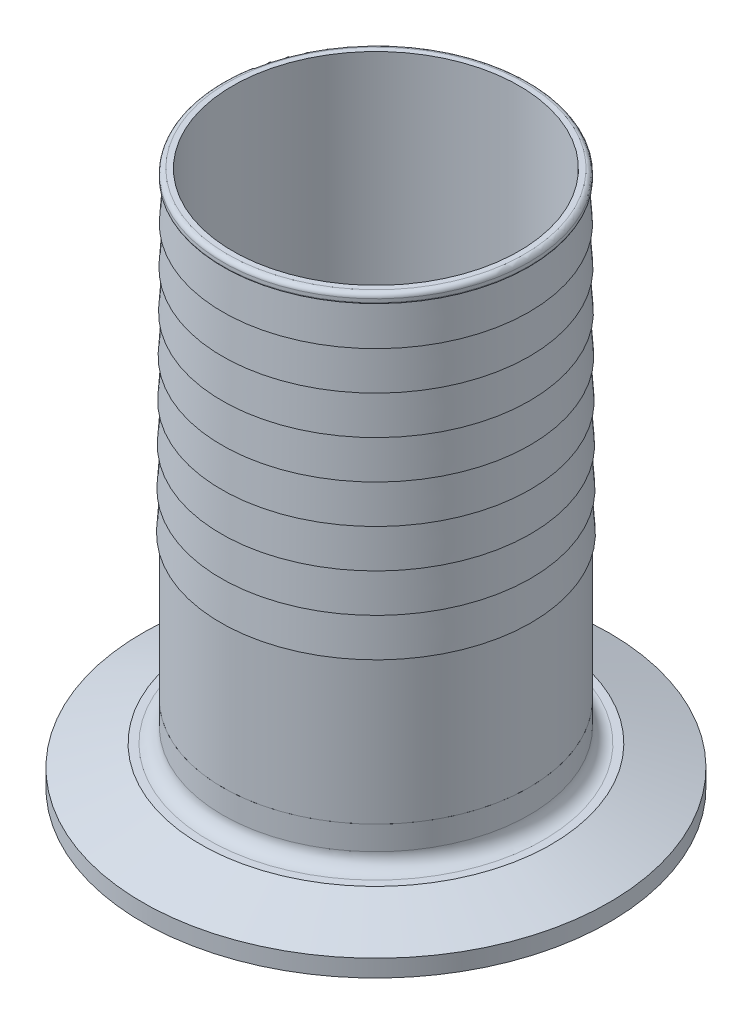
ISO-10303-21;
HEADER;
FILE_DESCRIPTION(('STEP AP214'),'2;1');
FILE_NAME('part.step','',(''),(''),'','','');
FILE_SCHEMA(('AUTOMOTIVE_DESIGN { 1 0 10303 214 1 1 1 1 }'));
ENDSEC;
DATA;
#1=APPLICATION_CONTEXT('core data for automotive mechanical design processes');
#2=APPLICATION_PROTOCOL_DEFINITION('international standard','automotive_design',2000,#1);
#3=PRODUCT_CONTEXT('',#1,'mechanical');
#4=PRODUCT('Part','Part','',(#3));
#5=PRODUCT_RELATED_PRODUCT_CATEGORY('part','',(#4));
#6=PRODUCT_DEFINITION_FORMATION('','',#4);
#7=PRODUCT_DEFINITION_CONTEXT('part definition',#1,'design');
#8=PRODUCT_DEFINITION('design','',#6,#7);
#9=PRODUCT_DEFINITION_SHAPE('','',#8);
#10=(LENGTH_UNIT() NAMED_UNIT(*) SI_UNIT(.MILLI.,.METRE.));
#11=(NAMED_UNIT(*) PLANE_ANGLE_UNIT() SI_UNIT($,.RADIAN.));
#12=(NAMED_UNIT(*) SI_UNIT($,.STERADIAN.) SOLID_ANGLE_UNIT());
#13=UNCERTAINTY_MEASURE_WITH_UNIT(LENGTH_MEASURE(1.E-05),#10,'distance_accuracy_value','');
#14=(GEOMETRIC_REPRESENTATION_CONTEXT(3) GLOBAL_UNCERTAINTY_ASSIGNED_CONTEXT((#13)) GLOBAL_UNIT_ASSIGNED_CONTEXT((#10,
#11,#12)) REPRESENTATION_CONTEXT('',''));
#15=CARTESIAN_POINT('',(0.,0.,0.));
#16=DIRECTION('',(0.,0.,1.));
#17=DIRECTION('',(1.,0.,0.));
#18=AXIS2_PLACEMENT_3D('',#15,#16,#17);
#19=CARTESIAN_POINT('',(57.9341349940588,46.6260461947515,65.4384429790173));
#20=DIRECTION('',(0.,-1.,0.));
#21=DIRECTION('',(0.146017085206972,0.,-0.989282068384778));
#22=AXIS2_PLACEMENT_3D('',#19,#20,#21);
#23=PLANE('',#22);
#24=CARTESIAN_POINT('',(32.8063704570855,46.6260461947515,61.7296090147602));
#25=DIRECTION('',(0.,-1.,0.));
#26=DIRECTION('',(0.146017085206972,0.,-0.989282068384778));
#27=AXIS2_PLACEMENT_3D('',#24,#25,#26);
#28=CIRCLE('',#27,23.749);
#29=CARTESIAN_POINT('',(36.2741302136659,46.6260461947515,38.2351491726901));
#30=VERTEX_POINT('',#29);
#31=EDGE_CURVE('P0_E88',#30,#30,#28,.T.);
#32=ORIENTED_EDGE('',*,*,#31,.F.);
#33=EDGE_LOOP('',(#32));
#34=FACE_BOUND('',#33,.T.);
#35=CARTESIAN_POINT('',(32.8063704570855,46.6260461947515,61.7296090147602));
#36=DIRECTION('',(0.,-1.,0.));
#37=DIRECTION('',(0.146017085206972,0.,-0.989282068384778));
#38=AXIS2_PLACEMENT_3D('',#35,#36,#37);
#39=CIRCLE('',#38,25.4);
#40=CARTESIAN_POINT('',(36.5152044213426,46.6260461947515,36.6018444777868));
#41=VERTEX_POINT('',#40);
#42=EDGE_CURVE('P0_E9',#41,#41,#39,.T.);
#43=ORIENTED_EDGE('',*,*,#42,.T.);
#44=EDGE_LOOP('',(#43));
#45=FACE_BOUND('',#44,.T.);
#46=ADVANCED_FACE('P0_F14',(#34,#45),#23,.T.);
#47=CARTESIAN_POINT('',(32.8063704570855,46.6260461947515,61.7296090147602));
#48=DIRECTION('',(0.,-1.,0.));
#49=DIRECTION('',(0.146017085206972,0.,-0.989282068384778));
#50=AXIS2_PLACEMENT_3D('',#47,#48,#49);
#51=CYLINDRICAL_SURFACE('',#50,25.4);
#52=CARTESIAN_POINT('',(32.8063704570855,70.4497298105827,61.7296090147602));
#53=DIRECTION('',(0.,-1.,0.));
#54=DIRECTION('',(0.146017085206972,0.,-0.989282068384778));
#55=AXIS2_PLACEMENT_3D('',#52,#53,#54);
#56=CIRCLE('',#55,25.4);
#57=CARTESIAN_POINT('',(36.5152044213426,70.4497298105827,36.6018444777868));
#58=VERTEX_POINT('',#57);
#59=EDGE_CURVE('P0_E20',#58,#58,#56,.T.);
#60=ORIENTED_EDGE('',*,*,#59,.T.);
#61=EDGE_LOOP('',(#60));
#62=FACE_BOUND('',#61,.T.);
#63=ORIENTED_EDGE('',*,*,#42,.F.);
#64=EDGE_LOOP('',(#63));
#65=FACE_BOUND('',#64,.T.);
#66=ADVANCED_FACE('P0_F104',(#62,#65),#51,.T.);
#67=CARTESIAN_POINT('',(58.2639369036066,70.4497271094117,65.4871214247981));
#68=DIRECTION('',(0.,-1.,0.));
#69=DIRECTION('',(0.146017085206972,0.,-0.989282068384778));
#70=AXIS2_PLACEMENT_3D('',#67,#68,#69);
#71=PLANE('',#70);
#72=CARTESIAN_POINT('',(32.8063704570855,70.4497244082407,61.7296090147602));
#73=DIRECTION('',(0.,-1.,0.));
#74=DIRECTION('',(0.146017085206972,0.,-0.989282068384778));
#75=AXIS2_PLACEMENT_3D('',#72,#73,#74);
#76=CIRCLE('',#75,25.733375);
#77=CARTESIAN_POINT('',(36.5638828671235,70.4497244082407,36.272042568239));
#78=VERTEX_POINT('',#77);
#79=EDGE_CURVE('P0_E24',#78,#78,#76,.T.);
#80=ORIENTED_EDGE('',*,*,#79,.T.);
#81=EDGE_LOOP('',(#80));
#82=FACE_BOUND('',#81,.T.);
#83=ORIENTED_EDGE('',*,*,#59,.F.);
#84=EDGE_LOOP('',(#83));
#85=FACE_BOUND('',#84,.T.);
#86=ADVANCED_FACE('P0_F109',(#82,#85),#71,.T.);
#87=CARTESIAN_POINT('',(32.8063704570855,70.4497244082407,61.7296090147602));
#88=DIRECTION('',(0.,-1.,0.));
#89=DIRECTION('',(0.146017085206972,0.,-0.989282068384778));
#90=AXIS2_PLACEMENT_3D('',#87,#88,#89);
#91=CONICAL_SURFACE('',#90,25.733375,0.0599260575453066);
#92=CARTESIAN_POINT('',(32.8063704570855,76.7999472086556,61.7296090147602));
#93=DIRECTION('',(0.,-1.,0.));
#94=DIRECTION('',(0.146017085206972,0.,-0.989282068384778));
#95=AXIS2_PLACEMENT_3D('',#92,#93,#94);
#96=CIRCLE('',#95,25.352375);
#97=CARTESIAN_POINT('',(36.5082503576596,76.7999472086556,36.6489590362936));
#98=VERTEX_POINT('',#97);
#99=EDGE_CURVE('P0_E28',#98,#98,#96,.T.);
#100=ORIENTED_EDGE('',*,*,#99,.T.);
#101=EDGE_LOOP('',(#100));
#102=FACE_BOUND('',#101,.T.);
#103=ORIENTED_EDGE('',*,*,#79,.F.);
#104=EDGE_LOOP('',(#103));
#105=FACE_BOUND('',#104,.T.);
#106=ADVANCED_FACE('P0_F113',(#102,#105),#91,.T.);
#107=CARTESIAN_POINT('',(58.2168223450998,76.7999445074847,65.4801673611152));
#108=DIRECTION('',(0.,-1.,0.));
#109=DIRECTION('',(0.146017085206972,0.,-0.989282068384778));
#110=AXIS2_PLACEMENT_3D('',#107,#108,#109);
#111=PLANE('',#110);
#112=CARTESIAN_POINT('',(32.8063704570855,76.7999418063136,61.7296090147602));
#113=DIRECTION('',(0.,-1.,0.));
#114=DIRECTION('',(0.146017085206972,0.,-0.989282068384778));
#115=AXIS2_PLACEMENT_3D('',#112,#113,#114);
#116=CIRCLE('',#115,25.68575);
#117=CARTESIAN_POINT('',(36.5569288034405,76.7999418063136,36.3191571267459));
#118=VERTEX_POINT('',#117);
#119=EDGE_CURVE('P0_E33',#118,#118,#116,.T.);
#120=ORIENTED_EDGE('',*,*,#119,.T.);
#121=EDGE_LOOP('',(#120));
#122=FACE_BOUND('',#121,.T.);
#123=ORIENTED_EDGE('',*,*,#99,.F.);
#124=EDGE_LOOP('',(#123));
#125=FACE_BOUND('',#124,.T.);
#126=ADVANCED_FACE('P0_F120',(#122,#125),#111,.T.);
#127=CARTESIAN_POINT('',(32.8063704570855,76.7999418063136,61.7296090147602));
#128=DIRECTION('',(0.,-1.,0.));
#129=DIRECTION('',(0.146017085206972,0.,-0.989282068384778));
#130=AXIS2_PLACEMENT_3D('',#127,#128,#129);
#131=CONICAL_SURFACE('',#130,25.68575,0.0599260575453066);
#132=CARTESIAN_POINT('',(32.8063704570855,83.1501646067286,61.7296090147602));
#133=DIRECTION('',(0.,-1.,0.));
#134=DIRECTION('',(0.146017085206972,0.,-0.989282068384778));
#135=AXIS2_PLACEMENT_3D('',#132,#133,#134);
#136=CIRCLE('',#135,25.30475);
#137=CARTESIAN_POINT('',(36.5012962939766,83.1501646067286,36.6960735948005));
#138=VERTEX_POINT('',#137);
#139=EDGE_CURVE('P0_E36',#138,#138,#136,.T.);
#140=ORIENTED_EDGE('',*,*,#139,.T.);
#141=EDGE_LOOP('',(#140));
#142=FACE_BOUND('',#141,.T.);
#143=ORIENTED_EDGE('',*,*,#119,.F.);
#144=EDGE_LOOP('',(#143));
#145=FACE_BOUND('',#144,.T.);
#146=ADVANCED_FACE('P0_F124',(#142,#145),#131,.T.);
#147=CARTESIAN_POINT('',(58.1697077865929,83.1501619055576,65.4732132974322));
#148=DIRECTION('',(0.,-1.,0.));
#149=DIRECTION('',(0.146017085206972,0.,-0.989282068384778));
#150=AXIS2_PLACEMENT_3D('',#147,#148,#149);
#151=PLANE('',#150);
#152=CARTESIAN_POINT('',(32.8063704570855,83.1501592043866,61.7296090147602));
#153=DIRECTION('',(0.,-1.,0.));
#154=DIRECTION('',(0.146017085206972,0.,-0.989282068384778));
#155=AXIS2_PLACEMENT_3D('',#152,#153,#154);
#156=CIRCLE('',#155,25.638125);
#157=CARTESIAN_POINT('',(36.5499747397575,83.1501592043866,36.3662716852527));
#158=VERTEX_POINT('',#157);
#159=EDGE_CURVE('P0_E39',#158,#158,#156,.T.);
#160=ORIENTED_EDGE('',*,*,#159,.T.);
#161=EDGE_LOOP('',(#160));
#162=FACE_BOUND('',#161,.T.);
#163=ORIENTED_EDGE('',*,*,#139,.F.);
#164=EDGE_LOOP('',(#163));
#165=FACE_BOUND('',#164,.T.);
#166=ADVANCED_FACE('P0_F128',(#162,#165),#151,.T.);
#167=CARTESIAN_POINT('',(32.8063704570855,83.1501592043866,61.7296090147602));
#168=DIRECTION('',(0.,-1.,0.));
#169=DIRECTION('',(0.146017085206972,0.,-0.989282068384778));
#170=AXIS2_PLACEMENT_3D('',#167,#168,#169);
#171=CONICAL_SURFACE('',#170,25.638125,0.0599260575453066);
#172=CARTESIAN_POINT('',(32.8063704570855,89.5003820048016,61.7296090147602));
#173=DIRECTION('',(0.,-1.,0.));
#174=DIRECTION('',(0.146017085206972,0.,-0.989282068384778));
#175=AXIS2_PLACEMENT_3D('',#172,#173,#174);
#176=CIRCLE('',#175,25.257125);
#177=CARTESIAN_POINT('',(36.4943422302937,89.5003820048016,36.7431881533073));
#178=VERTEX_POINT('',#177);
#179=EDGE_CURVE('P0_E42',#178,#178,#176,.T.);
#180=ORIENTED_EDGE('',*,*,#179,.T.);
#181=EDGE_LOOP('',(#180));
#182=FACE_BOUND('',#181,.T.);
#183=ORIENTED_EDGE('',*,*,#159,.F.);
#184=EDGE_LOOP('',(#183));
#185=FACE_BOUND('',#184,.T.);
#186=ADVANCED_FACE('P0_F132',(#182,#185),#171,.T.);
#187=CARTESIAN_POINT('',(58.1225932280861,89.5003793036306,65.4662592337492));
#188=DIRECTION('',(0.,-1.,0.));
#189=DIRECTION('',(0.146017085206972,0.,-0.989282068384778));
#190=AXIS2_PLACEMENT_3D('',#187,#188,#189);
#191=PLANE('',#190);
#192=CARTESIAN_POINT('',(32.8063704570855,89.5003766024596,61.7296090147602));
#193=DIRECTION('',(0.,-1.,0.));
#194=DIRECTION('',(0.146017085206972,0.,-0.989282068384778));
#195=AXIS2_PLACEMENT_3D('',#192,#193,#194);
#196=CIRCLE('',#195,25.5905);
#197=CARTESIAN_POINT('',(36.5430206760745,89.5003766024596,36.4133862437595));
#198=VERTEX_POINT('',#197);
#199=EDGE_CURVE('P0_E45',#198,#198,#196,.T.);
#200=ORIENTED_EDGE('',*,*,#199,.T.);
#201=EDGE_LOOP('',(#200));
#202=FACE_BOUND('',#201,.T.);
#203=ORIENTED_EDGE('',*,*,#179,.F.);
#204=EDGE_LOOP('',(#203));
#205=FACE_BOUND('',#204,.T.);
#206=ADVANCED_FACE('P0_F136',(#202,#205),#191,.T.);
#207=CARTESIAN_POINT('',(32.8063704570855,89.5003766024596,61.7296090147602));
#208=DIRECTION('',(0.,-1.,0.));
#209=DIRECTION('',(0.146017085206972,0.,-0.989282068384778));
#210=AXIS2_PLACEMENT_3D('',#207,#208,#209);
#211=CONICAL_SURFACE('',#210,25.5905,0.0599260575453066);
#212=CARTESIAN_POINT('',(32.8063704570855,95.8505994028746,61.7296090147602));
#213=DIRECTION('',(0.,-1.,0.));
#214=DIRECTION('',(0.146017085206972,0.,-0.989282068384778));
#215=AXIS2_PLACEMENT_3D('',#212,#213,#214);
#216=CIRCLE('',#215,25.2095);
#217=CARTESIAN_POINT('',(36.4873881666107,95.8505994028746,36.7903027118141));
#218=VERTEX_POINT('',#217);
#219=EDGE_CURVE('P0_E48',#218,#218,#216,.T.);
#220=ORIENTED_EDGE('',*,*,#219,.T.);
#221=EDGE_LOOP('',(#220));
#222=FACE_BOUND('',#221,.T.);
#223=ORIENTED_EDGE('',*,*,#199,.F.);
#224=EDGE_LOOP('',(#223));
#225=FACE_BOUND('',#224,.T.);
#226=ADVANCED_FACE('P0_F140',(#222,#225),#211,.T.);
#227=CARTESIAN_POINT('',(58.0754786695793,95.8505967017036,65.4593051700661));
#228=DIRECTION('',(0.,-1.,0.));
#229=DIRECTION('',(0.146017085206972,0.,-0.989282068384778));
#230=AXIS2_PLACEMENT_3D('',#227,#228,#229);
#231=PLANE('',#230);
#232=CARTESIAN_POINT('',(32.8063704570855,95.8505940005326,61.7296090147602));
#233=DIRECTION('',(0.,-1.,0.));
#234=DIRECTION('',(0.146017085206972,0.,-0.989282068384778));
#235=AXIS2_PLACEMENT_3D('',#232,#233,#234);
#236=CIRCLE('',#235,25.542875);
#237=CARTESIAN_POINT('',(36.5360666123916,95.8505940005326,36.4605008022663));
#238=VERTEX_POINT('',#237);
#239=EDGE_CURVE('P0_E51',#238,#238,#236,.T.);
#240=ORIENTED_EDGE('',*,*,#239,.T.);
#241=EDGE_LOOP('',(#240));
#242=FACE_BOUND('',#241,.T.);
#243=ORIENTED_EDGE('',*,*,#219,.F.);
#244=EDGE_LOOP('',(#243));
#245=FACE_BOUND('',#244,.T.);
#246=ADVANCED_FACE('P0_F144',(#242,#245),#231,.T.);
#247=CARTESIAN_POINT('',(32.8063704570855,95.8505940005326,61.7296090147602));
#248=DIRECTION('',(0.,-1.,0.));
#249=DIRECTION('',(0.146017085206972,0.,-0.989282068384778));
#250=AXIS2_PLACEMENT_3D('',#247,#248,#249);
#251=CONICAL_SURFACE('',#250,25.542875,0.0599260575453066);
#252=CARTESIAN_POINT('',(32.8063704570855,102.200816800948,61.7296090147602));
#253=DIRECTION('',(0.,-1.,0.));
#254=DIRECTION('',(0.146017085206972,0.,-0.989282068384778));
#255=AXIS2_PLACEMENT_3D('',#252,#253,#254);
#256=CIRCLE('',#255,25.161875);
#257=CARTESIAN_POINT('',(36.4804341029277,102.200816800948,36.8374172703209));
#258=VERTEX_POINT('',#257);
#259=EDGE_CURVE('P0_E54',#258,#258,#256,.T.);
#260=ORIENTED_EDGE('',*,*,#259,.T.);
#261=EDGE_LOOP('',(#260));
#262=FACE_BOUND('',#261,.T.);
#263=ORIENTED_EDGE('',*,*,#239,.F.);
#264=EDGE_LOOP('',(#263));
#265=FACE_BOUND('',#264,.T.);
#266=ADVANCED_FACE('P0_F148',(#262,#265),#251,.T.);
#267=CARTESIAN_POINT('',(58.0283641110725,102.200814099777,65.4523511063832));
#268=DIRECTION('',(0.,-1.,0.));
#269=DIRECTION('',(0.146017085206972,0.,-0.989282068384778));
#270=AXIS2_PLACEMENT_3D('',#267,#268,#269);
#271=PLANE('',#270);
#272=CARTESIAN_POINT('',(32.8063704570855,102.200811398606,61.7296090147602));
#273=DIRECTION('',(0.,-1.,0.));
#274=DIRECTION('',(0.146017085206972,0.,-0.989282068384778));
#275=AXIS2_PLACEMENT_3D('',#272,#273,#274);
#276=CIRCLE('',#275,25.49525);
#277=CARTESIAN_POINT('',(36.5291125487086,102.200811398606,36.5076153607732));
#278=VERTEX_POINT('',#277);
#279=EDGE_CURVE('P0_E57',#278,#278,#276,.T.);
#280=ORIENTED_EDGE('',*,*,#279,.T.);
#281=EDGE_LOOP('',(#280));
#282=FACE_BOUND('',#281,.T.);
#283=ORIENTED_EDGE('',*,*,#259,.F.);
#284=EDGE_LOOP('',(#283));
#285=FACE_BOUND('',#284,.T.);
#286=ADVANCED_FACE('P0_F152',(#282,#285),#271,.T.);
#287=CARTESIAN_POINT('',(32.8063704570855,102.200811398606,61.7296090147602));
#288=DIRECTION('',(0.,-1.,0.));
#289=DIRECTION('',(0.146017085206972,0.,-0.989282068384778));
#290=AXIS2_PLACEMENT_3D('',#287,#288,#289);
#291=CONICAL_SURFACE('',#290,25.49525,0.0599260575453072);
#292=CARTESIAN_POINT('',(32.8063704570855,108.551034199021,61.7296090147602));
#293=DIRECTION('',(0.,-1.,0.));
#294=DIRECTION('',(0.146017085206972,0.,-0.989282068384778));
#295=AXIS2_PLACEMENT_3D('',#292,#293,#294);
#296=CIRCLE('',#295,25.11425);
#297=CARTESIAN_POINT('',(36.4734800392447,108.551034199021,36.8845318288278));
#298=VERTEX_POINT('',#297);
#299=EDGE_CURVE('P0_E60',#298,#298,#296,.T.);
#300=ORIENTED_EDGE('',*,*,#299,.T.);
#301=EDGE_LOOP('',(#300));
#302=FACE_BOUND('',#301,.T.);
#303=ORIENTED_EDGE('',*,*,#279,.F.);
#304=EDGE_LOOP('',(#303));
#305=FACE_BOUND('',#304,.T.);
#306=ADVANCED_FACE('P0_F156',(#302,#305),#291,.T.);
#307=CARTESIAN_POINT('',(57.9812495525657,108.55103149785,65.4453970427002));
#308=DIRECTION('',(0.,-1.,0.));
#309=DIRECTION('',(0.146017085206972,0.,-0.989282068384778));
#310=AXIS2_PLACEMENT_3D('',#307,#308,#309);
#311=PLANE('',#310);
#312=CARTESIAN_POINT('',(32.8063704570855,108.551028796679,61.7296090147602));
#313=DIRECTION('',(0.,-1.,0.));
#314=DIRECTION('',(0.146017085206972,0.,-0.989282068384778));
#315=AXIS2_PLACEMENT_3D('',#312,#313,#314);
#316=CIRCLE('',#315,25.447625);
#317=CARTESIAN_POINT('',(36.5221584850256,108.551028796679,36.55472991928));
#318=VERTEX_POINT('',#317);
#319=EDGE_CURVE('P0_E63',#318,#318,#316,.T.);
#320=ORIENTED_EDGE('',*,*,#319,.T.);
#321=EDGE_LOOP('',(#320));
#322=FACE_BOUND('',#321,.T.);
#323=ORIENTED_EDGE('',*,*,#299,.F.);
#324=EDGE_LOOP('',(#323));
#325=FACE_BOUND('',#324,.T.);
#326=ADVANCED_FACE('P0_F160',(#322,#325),#311,.T.);
#327=CARTESIAN_POINT('',(32.8063704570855,108.551028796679,61.7296090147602));
#328=DIRECTION('',(0.,-1.,0.));
#329=DIRECTION('',(0.146017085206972,0.,-0.989282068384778));
#330=AXIS2_PLACEMENT_3D('',#327,#328,#329);
#331=CONICAL_SURFACE('',#330,25.447625,0.0599260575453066);
#332=CARTESIAN_POINT('',(32.8063704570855,114.901251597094,61.7296090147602));
#333=DIRECTION('',(0.,-1.,0.));
#334=DIRECTION('',(0.146017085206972,0.,-0.989282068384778));
#335=AXIS2_PLACEMENT_3D('',#332,#333,#334);
#336=CIRCLE('',#335,25.066625);
#337=CARTESIAN_POINT('',(36.4665259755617,114.901251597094,36.9316463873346));
#338=VERTEX_POINT('',#337);
#339=EDGE_CURVE('P0_E66',#338,#338,#336,.T.);
#340=ORIENTED_EDGE('',*,*,#339,.T.);
#341=EDGE_LOOP('',(#340));
#342=FACE_BOUND('',#341,.T.);
#343=ORIENTED_EDGE('',*,*,#319,.F.);
#344=EDGE_LOOP('',(#343));
#345=FACE_BOUND('',#344,.T.);
#346=ADVANCED_FACE('P0_F164',(#342,#345),#331,.T.);
#347=CARTESIAN_POINT('',(57.9341349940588,114.901248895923,65.4384429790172));
#348=DIRECTION('',(0.,-1.,0.));
#349=DIRECTION('',(0.146017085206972,0.,-0.989282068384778));
#350=AXIS2_PLACEMENT_3D('',#347,#348,#349);
#351=PLANE('',#350);
#352=CARTESIAN_POINT('',(32.8063704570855,114.901246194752,61.7296090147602));
#353=DIRECTION('',(0.,-1.,0.));
#354=DIRECTION('',(0.146017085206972,0.,-0.989282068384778));
#355=AXIS2_PLACEMENT_3D('',#352,#353,#354);
#356=CIRCLE('',#355,25.4);
#357=CARTESIAN_POINT('',(36.5152044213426,114.901246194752,36.6018444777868));
#358=VERTEX_POINT('',#357);
#359=EDGE_CURVE('P0_E69',#358,#358,#356,.T.);
#360=ORIENTED_EDGE('',*,*,#359,.T.);
#361=EDGE_LOOP('',(#360));
#362=FACE_BOUND('',#361,.T.);
#363=ORIENTED_EDGE('',*,*,#339,.F.);
#364=EDGE_LOOP('',(#363));
#365=FACE_BOUND('',#364,.T.);
#366=ADVANCED_FACE('P0_F168',(#362,#365),#351,.T.);
#367=CARTESIAN_POINT('',(32.8063704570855,114.901246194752,61.7296090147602));
#368=DIRECTION('',(0.,-1.,0.));
#369=DIRECTION('',(0.146017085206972,0.,-0.989282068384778));
#370=AXIS2_PLACEMENT_3D('',#367,#368,#369);
#371=CONICAL_SURFACE('',#370,25.4,0.0599260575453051);
#372=CARTESIAN_POINT('',(32.8063704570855,121.251468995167,61.7296090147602));
#373=DIRECTION('',(0.,-1.,0.));
#374=DIRECTION('',(0.146017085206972,0.,-0.989282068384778));
#375=AXIS2_PLACEMENT_3D('',#372,#373,#374);
#376=CIRCLE('',#375,25.019);
#377=CARTESIAN_POINT('',(36.4595719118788,121.251468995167,36.9787609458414));
#378=VERTEX_POINT('',#377);
#379=EDGE_CURVE('P0_E72',#378,#378,#376,.T.);
#380=ORIENTED_EDGE('',*,*,#379,.T.);
#381=EDGE_LOOP('',(#380));
#382=FACE_BOUND('',#381,.T.);
#383=ORIENTED_EDGE('',*,*,#359,.F.);
#384=EDGE_LOOP('',(#383));
#385=FACE_BOUND('',#384,.T.);
#386=ADVANCED_FACE('P0_F172',(#382,#385),#371,.T.);
#387=CARTESIAN_POINT('',(32.8063704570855,121.251468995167,61.7296090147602));
#388=DIRECTION('',(0.,-1.,0.));
#389=DIRECTION('',(0.146017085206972,0.,-0.989282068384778));
#390=AXIS2_PLACEMENT_3D('',#387,#388,#389);
#391=CONICAL_SURFACE('',#390,25.019,1.57021154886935);
#392=CARTESIAN_POINT('',(32.8063704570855,121.251394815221,61.7296090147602));
#393=DIRECTION('',(0.,-1.,0.));
#394=DIRECTION('',(0.146017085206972,0.,-0.989282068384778));
#395=AXIS2_PLACEMENT_3D('',#392,#393,#394);
#396=CIRCLE('',#395,25.1458514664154);
#397=CARTESIAN_POINT('',(36.478094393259,121.251394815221,36.8532690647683));
#398=VERTEX_POINT('',#397);
#399=EDGE_CURVE('P0_E75',#398,#398,#396,.T.);
#400=ORIENTED_EDGE('',*,*,#399,.T.);
#401=EDGE_LOOP('',(#400));
#402=FACE_BOUND('',#401,.T.);
#403=ORIENTED_EDGE('',*,*,#379,.F.);
#404=EDGE_LOOP('',(#403));
#405=FACE_BOUND('',#404,.T.);
#406=ADVANCED_FACE('P0_F176',(#402,#405),#391,.F.);
#407=CARTESIAN_POINT('',(32.8063704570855,121.505394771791,61.7296090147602));
#408=DIRECTION('',(0.,-1.,0.));
#409=DIRECTION('',(0.146017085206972,0.,-0.989282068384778));
#410=AXIS2_PLACEMENT_3D('',#407,#408,#409);
#411=TOROIDAL_SURFACE('',#410,25.146,0.254000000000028);
#412=CARTESIAN_POINT('',(32.8063704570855,121.505394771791,61.7296090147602));
#413=DIRECTION('',(0.,-1.,0.));
#414=DIRECTION('',(0.146017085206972,0.,-0.989282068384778));
#415=AXIS2_PLACEMENT_3D('',#412,#413,#414);
#416=CIRCLE('',#415,25.4);
#417=CARTESIAN_POINT('',(36.5152044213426,121.505394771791,36.6018444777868));
#418=VERTEX_POINT('',#417);
#419=EDGE_CURVE('P0_E78',#418,#418,#416,.T.);
#420=ORIENTED_EDGE('',*,*,#419,.T.);
#421=EDGE_LOOP('',(#420));
#422=FACE_BOUND('',#421,.T.);
#423=ORIENTED_EDGE('',*,*,#399,.F.);
#424=EDGE_LOOP('',(#423));
#425=FACE_BOUND('',#424,.T.);
#426=ADVANCED_FACE('P0_F180',(#422,#425),#411,.T.);
#427=CARTESIAN_POINT('',(32.8063704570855,46.6260461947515,61.7296090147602));
#428=DIRECTION('',(0.,-1.,0.));
#429=DIRECTION('',(0.146017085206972,0.,-0.989282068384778));
#430=AXIS2_PLACEMENT_3D('',#427,#428,#429);
#431=CYLINDRICAL_SURFACE('',#430,25.4);
#432=CARTESIAN_POINT('',(32.8063704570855,122.064046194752,61.7296090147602));
#433=DIRECTION('',(0.,-1.,0.));
#434=DIRECTION('',(0.146017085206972,0.,-0.989282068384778));
#435=AXIS2_PLACEMENT_3D('',#432,#433,#434);
#436=CIRCLE('',#435,25.4);
#437=CARTESIAN_POINT('',(36.5152044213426,122.064046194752,36.6018444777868));
#438=VERTEX_POINT('',#437);
#439=EDGE_CURVE('P0_E81',#438,#438,#436,.T.);
#440=ORIENTED_EDGE('',*,*,#439,.T.);
#441=EDGE_LOOP('',(#440));
#442=FACE_BOUND('',#441,.T.);
#443=ORIENTED_EDGE('',*,*,#419,.F.);
#444=EDGE_LOOP('',(#443));
#445=FACE_BOUND('',#444,.T.);
#446=ADVANCED_FACE('P0_F184',(#442,#445),#431,.T.);
#447=CARTESIAN_POINT('',(32.8063704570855,122.064046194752,61.7296090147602));
#448=DIRECTION('',(0.,-1.,0.));
#449=DIRECTION('',(0.146017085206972,0.,-0.989282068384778));
#450=AXIS2_PLACEMENT_3D('',#447,#448,#449);
#451=TOROIDAL_SURFACE('',#450,24.638,0.761999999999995);
#452=CARTESIAN_POINT('',(32.8063704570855,122.826046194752,61.7296090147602));
#453=DIRECTION('',(0.,-1.,0.));
#454=DIRECTION('',(0.146017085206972,0.,-0.989282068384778));
#455=AXIS2_PLACEMENT_3D('',#452,#453,#454);
#456=CIRCLE('',#455,24.638);
#457=CARTESIAN_POINT('',(36.4039394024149,122.826046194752,37.355677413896));
#458=VERTEX_POINT('',#457);
#459=EDGE_CURVE('P0_E84',#458,#458,#456,.T.);
#460=ORIENTED_EDGE('',*,*,#459,.T.);
#461=EDGE_LOOP('',(#460));
#462=FACE_BOUND('',#461,.T.);
#463=ORIENTED_EDGE('',*,*,#439,.F.);
#464=EDGE_LOOP('',(#463));
#465=FACE_BOUND('',#464,.T.);
#466=ADVANCED_FACE('P0_F188',(#462,#465),#451,.T.);
#467=CARTESIAN_POINT('',(32.8063704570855,122.826046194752,61.7296090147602));
#468=DIRECTION('',(0.,1.,0.));
#469=DIRECTION('',(-0.146017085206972,0.,0.989282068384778));
#470=AXIS2_PLACEMENT_3D('',#467,#468,#469);
#471=PLANE('',#470);
#472=CARTESIAN_POINT('',(32.8063704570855,122.826046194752,61.7296090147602));
#473=DIRECTION('',(0.,-1.,0.));
#474=DIRECTION('',(0.146017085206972,0.,-0.989282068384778));
#475=AXIS2_PLACEMENT_3D('',#472,#473,#474);
#476=CIRCLE('',#475,23.749);
#477=CARTESIAN_POINT('',(36.2741302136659,122.826046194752,38.2351491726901));
#478=VERTEX_POINT('',#477);
#479=EDGE_CURVE('P0_E87',#478,#478,#476,.T.);
#480=ORIENTED_EDGE('',*,*,#479,.T.);
#481=EDGE_LOOP('',(#480));
#482=FACE_BOUND('',#481,.T.);
#483=ORIENTED_EDGE('',*,*,#459,.F.);
#484=EDGE_LOOP('',(#483));
#485=FACE_BOUND('',#484,.T.);
#486=ADVANCED_FACE('P0_F94',(#482,#485),#471,.T.);
#487=CARTESIAN_POINT('',(32.8063704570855,122.826046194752,61.7296090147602));
#488=DIRECTION('',(0.,-1.,0.));
#489=DIRECTION('',(0.146017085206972,0.,-0.989282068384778));
#490=AXIS2_PLACEMENT_3D('',#487,#488,#489);
#491=CYLINDRICAL_SURFACE('',#490,23.749);
#492=CARTESIAN_POINT('',(36.2741302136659,122.826046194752,38.2351491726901));
#493=CARTESIAN_POINT('',(36.2741302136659,122.032296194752,38.2351491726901));
#494=CARTESIAN_POINT('',(36.2741302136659,121.238546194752,38.2351491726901));
#495=CARTESIAN_POINT('',(36.2741302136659,119.651046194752,38.2351491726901));
#496=CARTESIAN_POINT('',(36.2741302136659,118.857296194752,38.2351491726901));
#497=CARTESIAN_POINT('',(36.2741302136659,117.269796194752,38.2351491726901));
#498=CARTESIAN_POINT('',(36.2741302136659,116.476046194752,38.2351491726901));
#499=CARTESIAN_POINT('',(36.2741302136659,114.888546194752,38.2351491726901));
#500=CARTESIAN_POINT('',(36.2741302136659,114.094796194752,38.2351491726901));
#501=CARTESIAN_POINT('',(36.2741302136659,112.507296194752,38.2351491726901));
#502=CARTESIAN_POINT('',(36.2741302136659,111.713546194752,38.2351491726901));
#503=CARTESIAN_POINT('',(36.2741302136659,110.126046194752,38.2351491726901));
#504=CARTESIAN_POINT('',(36.2741302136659,109.332296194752,38.2351491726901));
#505=CARTESIAN_POINT('',(36.2741302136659,107.744796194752,38.2351491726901));
#506=CARTESIAN_POINT('',(36.2741302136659,106.951046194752,38.2351491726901));
#507=CARTESIAN_POINT('',(36.2741302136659,105.363546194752,38.2351491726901));
#508=CARTESIAN_POINT('',(36.2741302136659,104.569796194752,38.2351491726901));
#509=CARTESIAN_POINT('',(36.2741302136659,102.982296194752,38.2351491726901));
#510=CARTESIAN_POINT('',(36.2741302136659,102.188546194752,38.2351491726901));
#511=CARTESIAN_POINT('',(36.2741302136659,100.601046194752,38.2351491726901));
#512=CARTESIAN_POINT('',(36.2741302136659,99.8072961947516,38.2351491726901));
#513=CARTESIAN_POINT('',(36.2741302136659,98.2197961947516,38.2351491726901));
#514=CARTESIAN_POINT('',(36.2741302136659,97.4260461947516,38.2351491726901));
#515=CARTESIAN_POINT('',(36.2741302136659,95.8385461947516,38.2351491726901));
#516=CARTESIAN_POINT('',(36.2741302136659,95.0447961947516,38.2351491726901));
#517=CARTESIAN_POINT('',(36.2741302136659,93.4572961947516,38.2351491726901));
#518=CARTESIAN_POINT('',(36.2741302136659,92.6635461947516,38.2351491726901));
#519=CARTESIAN_POINT('',(36.2741302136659,91.0760461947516,38.2351491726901));
#520=CARTESIAN_POINT('',(36.2741302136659,90.2822961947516,38.2351491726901));
#521=CARTESIAN_POINT('',(36.2741302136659,88.6947961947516,38.2351491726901));
#522=CARTESIAN_POINT('',(36.2741302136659,87.9010461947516,38.2351491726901));
#523=CARTESIAN_POINT('',(36.2741302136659,86.3135461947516,38.2351491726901));
#524=CARTESIAN_POINT('',(36.2741302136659,85.5197961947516,38.2351491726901));
#525=CARTESIAN_POINT('',(36.2741302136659,83.9322961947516,38.2351491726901));
#526=CARTESIAN_POINT('',(36.2741302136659,83.1385461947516,38.2351491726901));
#527=CARTESIAN_POINT('',(36.2741302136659,81.5510461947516,38.2351491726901));
#528=CARTESIAN_POINT('',(36.2741302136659,80.7572961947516,38.2351491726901));
#529=CARTESIAN_POINT('',(36.2741302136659,79.1697961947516,38.2351491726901));
#530=CARTESIAN_POINT('',(36.2741302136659,78.3760461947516,38.2351491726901));
#531=CARTESIAN_POINT('',(36.2741302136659,76.7885461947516,38.2351491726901));
#532=CARTESIAN_POINT('',(36.2741302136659,75.9947961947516,38.2351491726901));
#533=CARTESIAN_POINT('',(36.2741302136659,74.4072961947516,38.2351491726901));
#534=CARTESIAN_POINT('',(36.2741302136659,73.6135461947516,38.2351491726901));
#535=CARTESIAN_POINT('',(36.2741302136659,72.0260461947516,38.2351491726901));
#536=CARTESIAN_POINT('',(36.2741302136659,71.2322961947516,38.2351491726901));
#537=CARTESIAN_POINT('',(36.2741302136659,69.6447961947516,38.2351491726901));
#538=CARTESIAN_POINT('',(36.2741302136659,68.8510461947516,38.2351491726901));
#539=CARTESIAN_POINT('',(36.2741302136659,67.2635461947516,38.2351491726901));
#540=CARTESIAN_POINT('',(36.2741302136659,66.4697961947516,38.2351491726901));
#541=CARTESIAN_POINT('',(36.2741302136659,64.8822961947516,38.2351491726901));
#542=CARTESIAN_POINT('',(36.2741302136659,64.0885461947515,38.2351491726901));
#543=CARTESIAN_POINT('',(36.2741302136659,62.5010461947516,38.2351491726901));
#544=CARTESIAN_POINT('',(36.2741302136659,61.7072961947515,38.2351491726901));
#545=CARTESIAN_POINT('',(36.2741302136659,60.1197961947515,38.2351491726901));
#546=CARTESIAN_POINT('',(36.2741302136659,59.3260461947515,38.2351491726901));
#547=CARTESIAN_POINT('',(36.2741302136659,57.7385461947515,38.2351491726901));
#548=CARTESIAN_POINT('',(36.2741302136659,56.9447961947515,38.2351491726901));
#549=CARTESIAN_POINT('',(36.2741302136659,55.3572961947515,38.2351491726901));
#550=CARTESIAN_POINT('',(36.2741302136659,54.5635461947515,38.2351491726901));
#551=CARTESIAN_POINT('',(36.2741302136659,52.9760461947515,38.2351491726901));
#552=CARTESIAN_POINT('',(36.2741302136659,52.1822961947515,38.2351491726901));
#553=CARTESIAN_POINT('',(36.2741302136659,50.5947961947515,38.2351491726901));
#554=CARTESIAN_POINT('',(36.2741302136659,49.8010461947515,38.2351491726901));
#555=CARTESIAN_POINT('',(36.2741302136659,48.2135461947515,38.2351491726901));
#556=CARTESIAN_POINT('',(36.2741302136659,47.4197961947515,38.2351491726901));
#557=CARTESIAN_POINT('',(36.2741302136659,46.6260461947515,38.2351491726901));
#558=B_SPLINE_CURVE_WITH_KNOTS('',3,(#492,#493,#494,#495,#496,#497,#498,#499,#500,#501,#502,
#503,#504,#505,#506,#507,#508,#509,#510,#511,#512,#513,#514,#515,#516,#517,#518,#519,#520,#521,
#522,#523,#524,#525,#526,#527,#528,#529,#530,#531,#532,#533,#534,#535,#536,#537,#538,#539,#540,
#541,#542,#543,#544,#545,#546,#547,#548,#549,#550,#551,#552,#553,#554,#555,#556,#557),
.UNSPECIFIED.,.F.,.F.,(4,2,2,2,2,2,2,2,2,2,2,2,2,2,2,2,2,2,2,2,2,2,2,2,2,2,2,2,2,2,2,2,4),(0.,
2.38124999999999,4.76249999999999,7.14375,9.52499999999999,11.90625,14.2875,16.66875,19.05,
21.43125,23.8125,26.19375,28.575,30.95625,33.3375,35.71875,38.1,40.48125,42.8625,45.24375,
47.625,50.00625,52.3875,54.76875,57.15,59.53125,61.9125,64.29375,66.675,69.05625,71.4375,
73.8187500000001,76.2),.UNSPECIFIED.);
#559=EDGE_CURVE('P0_BSEAM97',#478,#30,#558,.T.);
#560=ORIENTED_EDGE('',*,*,#479,.F.);
#561=ORIENTED_EDGE('',*,*,#31,.T.);
#562=ORIENTED_EDGE('',*,*,#559,.T.);
#563=ORIENTED_EDGE('',*,*,#559,.F.);
#564=EDGE_LOOP('',(#560,#562,#561,#563));
#565=FACE_BOUND('',#564,.T.);
#566=ADVANCED_FACE('P0_F97',(#565),#491,.F.);
#567=CLOSED_SHELL('',(#46,#66,#86,#106,#126,#146,#166,#186,#206,#226,#246,#266,#286,#306,#326,
#346,#366,#386,#406,#426,#446,#466,#486,#566));
#568=MANIFOLD_SOLID_BREP('P0_B1',#567);
#569=CARTESIAN_POINT('',(9.05737045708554,46.6260461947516,61.7296090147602));
#570=DIRECTION('',(0.,-1.,0.));
#571=DIRECTION('',(0.,0.,-1.));
#572=AXIS2_PLACEMENT_3D('',#569,#570,#571);
#573=PLANE('',#572);
#574=CARTESIAN_POINT('',(32.8063704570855,46.6260461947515,61.7296090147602));
#575=DIRECTION('',(0.,-1.,0.));
#576=DIRECTION('',(0.,0.,-1.));
#577=AXIS2_PLACEMENT_3D('',#574,#575,#576);
#578=CIRCLE('',#577,25.4);
#579=CARTESIAN_POINT('',(32.8063704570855,46.6260461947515,36.3296090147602));
#580=VERTEX_POINT('',#579);
#581=EDGE_CURVE('P1_E10',#580,#580,#578,.T.);
#582=ORIENTED_EDGE('',*,*,#581,.F.);
#583=EDGE_LOOP('',(#582));
#584=FACE_BOUND('',#583,.T.);
#585=CARTESIAN_POINT('',(32.8063704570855,46.6260461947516,61.7296090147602));
#586=DIRECTION('',(0.,-1.,0.));
#587=DIRECTION('',(0.,0.,-1.));
#588=AXIS2_PLACEMENT_3D('',#585,#586,#587);
#589=CIRCLE('',#588,23.749);
#590=CARTESIAN_POINT('',(32.8063704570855,46.6260461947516,37.9806090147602));
#591=VERTEX_POINT('',#590);
#592=EDGE_CURVE('P1_E64',#591,#591,#589,.T.);
#593=ORIENTED_EDGE('',*,*,#592,.T.);
#594=EDGE_LOOP('',(#593));
#595=FACE_BOUND('',#594,.T.);
#596=ADVANCED_FACE('P1_F15',(#584,#595),#573,.F.);
#597=CARTESIAN_POINT('',(32.8063704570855,33.9260461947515,61.7296090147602));
#598=DIRECTION('',(0.,-1.,0.));
#599=DIRECTION('',(0.,0.,-1.));
#600=AXIS2_PLACEMENT_3D('',#597,#598,#599);
#601=CYLINDRICAL_SURFACE('',#600,25.4);
#602=CARTESIAN_POINT('',(32.8063704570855,42.6636461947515,61.7296090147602));
#603=DIRECTION('',(0.,-1.,0.));
#604=DIRECTION('',(0.,0.,-1.));
#605=AXIS2_PLACEMENT_3D('',#602,#603,#604);
#606=CIRCLE('',#605,25.4);
#607=CARTESIAN_POINT('',(32.8063704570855,42.6636461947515,36.3296090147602));
#608=VERTEX_POINT('',#607);
#609=EDGE_CURVE('P1_E21',#608,#608,#606,.T.);
#610=ORIENTED_EDGE('',*,*,#609,.F.);
#611=EDGE_LOOP('',(#610));
#612=FACE_BOUND('',#611,.T.);
#613=ORIENTED_EDGE('',*,*,#581,.T.);
#614=EDGE_LOOP('',(#613));
#615=FACE_BOUND('',#614,.T.);
#616=ADVANCED_FACE('P1_F143',(#612,#615),#601,.T.);
#617=CARTESIAN_POINT('',(32.8063704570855,42.6636461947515,61.7296090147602));
#618=DIRECTION('',(0.,-1.,0.));
#619=DIRECTION('',(0.,0.,-1.));
#620=AXIS2_PLACEMENT_3D('',#617,#618,#619);
#621=TOROIDAL_SURFACE('',#620,27.7876,2.3876);
#622=CARTESIAN_POINT('',(32.8063704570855,40.2760461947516,61.7296090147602));
#623=DIRECTION('',(0.,-1.,0.));
#624=DIRECTION('',(0.,0.,-1.));
#625=AXIS2_PLACEMENT_3D('',#622,#623,#624);
#626=CIRCLE('',#625,27.7876);
#627=CARTESIAN_POINT('',(32.8063704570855,40.2760461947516,33.9420090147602));
#628=VERTEX_POINT('',#627);
#629=EDGE_CURVE('P1_E25',#628,#628,#626,.T.);
#630=ORIENTED_EDGE('',*,*,#629,.F.);
#631=EDGE_LOOP('',(#630));
#632=FACE_BOUND('',#631,.T.);
#633=ORIENTED_EDGE('',*,*,#609,.T.);
#634=EDGE_LOOP('',(#633));
#635=FACE_BOUND('',#634,.T.);
#636=ADVANCED_FACE('P1_F138',(#632,#635),#621,.F.);
#637=CARTESIAN_POINT('',(5.01877045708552,40.2760461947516,61.7296090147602));
#638=DIRECTION('',(0.,-1.,0.));
#639=DIRECTION('',(0.,0.,-1.));
#640=AXIS2_PLACEMENT_3D('',#637,#638,#639);
#641=PLANE('',#640);
#642=CARTESIAN_POINT('',(32.8063704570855,40.2760461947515,61.7296090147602));
#643=DIRECTION('',(0.,-1.,0.));
#644=DIRECTION('',(0.,0.,-1.));
#645=AXIS2_PLACEMENT_3D('',#642,#643,#644);
#646=CIRCLE('',#645,29.0664421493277);
#647=CARTESIAN_POINT('',(32.8063704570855,40.2760461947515,32.6631668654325));
#648=VERTEX_POINT('',#647);
#649=EDGE_CURVE('P1_E29',#648,#648,#646,.T.);
#650=ORIENTED_EDGE('',*,*,#649,.F.);
#651=EDGE_LOOP('',(#650));
#652=FACE_BOUND('',#651,.T.);
#653=ORIENTED_EDGE('',*,*,#629,.T.);
#654=EDGE_LOOP('',(#653));
#655=FACE_BOUND('',#654,.T.);
#656=ADVANCED_FACE('P1_F132',(#652,#655),#641,.F.);
#657=CARTESIAN_POINT('',(32.8063704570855,40.2760461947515,61.7296090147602));
#658=DIRECTION('',(0.,-1.,0.));
#659=DIRECTION('',(0.,0.,-1.));
#660=AXIS2_PLACEMENT_3D('',#657,#658,#659);
#661=CONICAL_SURFACE('',#660,29.0664421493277,1.22173047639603);
#662=CARTESIAN_POINT('',(32.8063704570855,36.7708461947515,61.7296090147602));
#663=DIRECTION('',(0.,-1.,0.));
#664=DIRECTION('',(0.,0.,-1.));
#665=AXIS2_PLACEMENT_3D('',#662,#663,#664);
#666=CIRCLE('',#665,38.6969);
#667=CARTESIAN_POINT('',(32.8063704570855,36.7708461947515,23.0327090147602));
#668=VERTEX_POINT('',#667);
#669=EDGE_CURVE('P1_E34',#668,#668,#666,.T.);
#670=ORIENTED_EDGE('',*,*,#669,.F.);
#671=EDGE_LOOP('',(#670));
#672=FACE_BOUND('',#671,.T.);
#673=ORIENTED_EDGE('',*,*,#649,.T.);
#674=EDGE_LOOP('',(#673));
#675=FACE_BOUND('',#674,.T.);
#676=ADVANCED_FACE('P1_F126',(#672,#675),#661,.T.);
#677=CARTESIAN_POINT('',(32.8063704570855,33.9260461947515,61.7296090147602));
#678=DIRECTION('',(0.,-1.,0.));
#679=DIRECTION('',(0.,0.,-1.));
#680=AXIS2_PLACEMENT_3D('',#677,#678,#679);
#681=CYLINDRICAL_SURFACE('',#680,38.6969);
#682=CARTESIAN_POINT('',(32.8063704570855,33.9260461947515,61.7296090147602));
#683=DIRECTION('',(0.,-1.,0.));
#684=DIRECTION('',(0.,0.,-1.));
#685=AXIS2_PLACEMENT_3D('',#682,#683,#684);
#686=CIRCLE('',#685,38.6969);
#687=CARTESIAN_POINT('',(32.8063704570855,33.9260461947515,23.0327090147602));
#688=VERTEX_POINT('',#687);
#689=EDGE_CURVE('P1_E37',#688,#688,#686,.T.);
#690=ORIENTED_EDGE('',*,*,#689,.F.);
#691=EDGE_LOOP('',(#690));
#692=FACE_BOUND('',#691,.T.);
#693=ORIENTED_EDGE('',*,*,#669,.T.);
#694=EDGE_LOOP('',(#693));
#695=FACE_BOUND('',#694,.T.);
#696=ADVANCED_FACE('P1_F120',(#692,#695),#681,.T.);
#697=CARTESIAN_POINT('',(32.8063704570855,33.9260461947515,61.7296090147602));
#698=DIRECTION('',(0.,-1.,0.));
#699=DIRECTION('',(0.,0.,-1.));
#700=AXIS2_PLACEMENT_3D('',#697,#698,#699);
#701=CONICAL_SURFACE('',#700,38.6969,1.56939586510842);
#702=CARTESIAN_POINT('',(32.8063704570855,33.9285586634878,61.7296090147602));
#703=DIRECTION('',(0.,-1.,0.));
#704=DIRECTION('',(0.,0.,-1.));
#705=AXIS2_PLACEMENT_3D('',#702,#703,#704);
#706=CIRCLE('',#705,36.9028722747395);
#707=CARTESIAN_POINT('',(32.8063704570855,33.9285586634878,24.8267367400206));
#708=VERTEX_POINT('',#707);
#709=EDGE_CURVE('P1_E40',#708,#708,#706,.T.);
#710=ORIENTED_EDGE('',*,*,#709,.F.);
#711=EDGE_LOOP('',(#710));
#712=FACE_BOUND('',#711,.T.);
#713=ORIENTED_EDGE('',*,*,#689,.T.);
#714=EDGE_LOOP('',(#713));
#715=FACE_BOUND('',#714,.T.);
#716=ADVANCED_FACE('P1_F114',(#712,#715),#701,.F.);
#717=CARTESIAN_POINT('',(32.8063704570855,34.7159586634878,61.7296090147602));
#718=DIRECTION('',(0.,-1.,0.));
#719=DIRECTION('',(0.,0.,-1.));
#720=AXIS2_PLACEMENT_3D('',#717,#718,#719);
#721=TOROIDAL_SURFACE('',#720,36.9028722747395,0.787400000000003);
#722=CARTESIAN_POINT('',(32.8063704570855,34.4082969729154,61.7296090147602));
#723=DIRECTION('',(0.,-1.,0.));
#724=DIRECTION('',(0.,0.,-1.));
#725=AXIS2_PLACEMENT_3D('',#722,#723,#724);
#726=CIRCLE('',#725,36.178066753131);
#727=CARTESIAN_POINT('',(32.8063704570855,34.4082969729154,25.5515422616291));
#728=VERTEX_POINT('',#727);
#729=EDGE_CURVE('P1_E43',#728,#728,#726,.T.);
#730=ORIENTED_EDGE('',*,*,#729,.F.);
#731=EDGE_LOOP('',(#730));
#732=FACE_BOUND('',#731,.T.);
#733=ORIENTED_EDGE('',*,*,#709,.T.);
#734=EDGE_LOOP('',(#733));
#735=FACE_BOUND('',#734,.T.);
#736=ADVANCED_FACE('P1_F108',(#732,#735),#721,.T.);
#737=CARTESIAN_POINT('',(32.8063704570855,34.4082969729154,61.7296090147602));
#738=DIRECTION('',(0.,-1.,0.));
#739=DIRECTION('',(0.,0.,-1.));
#740=AXIS2_PLACEMENT_3D('',#737,#738,#739);
#741=CONICAL_SURFACE('',#740,36.178066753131,0.401425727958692);
#742=CARTESIAN_POINT('',(32.8063704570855,34.6552436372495,61.7296090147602));
#743=DIRECTION('',(0.,-1.,0.));
#744=DIRECTION('',(0.,0.,-1.));
#745=AXIS2_PLACEMENT_3D('',#742,#743,#744);
#746=CIRCLE('',#745,36.0732441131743);
#747=CARTESIAN_POINT('',(32.8063704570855,34.6552436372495,25.6563649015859));
#748=VERTEX_POINT('',#747);
#749=EDGE_CURVE('P1_E46',#748,#748,#746,.T.);
#750=ORIENTED_EDGE('',*,*,#749,.F.);
#751=EDGE_LOOP('',(#750));
#752=FACE_BOUND('',#751,.T.);
#753=ORIENTED_EDGE('',*,*,#729,.T.);
#754=EDGE_LOOP('',(#753));
#755=FACE_BOUND('',#754,.T.);
#756=ADVANCED_FACE('P1_F102',(#752,#755),#741,.F.);
#757=CARTESIAN_POINT('',(32.8063704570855,34.3349586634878,61.7296090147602));
#758=DIRECTION('',(0.,-1.,0.));
#759=DIRECTION('',(0.,0.,-1.));
#760=AXIS2_PLACEMENT_3D('',#757,#758,#759);
#761=TOROIDAL_SURFACE('',#760,35.3187,0.81970682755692);
#762=CARTESIAN_POINT('',(32.8063704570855,34.6552436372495,61.7296090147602));
#763=DIRECTION('',(0.,-1.,0.));
#764=DIRECTION('',(0.,0.,-1.));
#765=AXIS2_PLACEMENT_3D('',#762,#763,#764);
#766=CIRCLE('',#765,34.5641558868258);
#767=CARTESIAN_POINT('',(32.8063704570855,34.6552436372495,27.1654531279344));
#768=VERTEX_POINT('',#767);
#769=EDGE_CURVE('P1_E49',#768,#768,#766,.T.);
#770=ORIENTED_EDGE('',*,*,#769,.F.);
#771=EDGE_LOOP('',(#770));
#772=FACE_BOUND('',#771,.T.);
#773=ORIENTED_EDGE('',*,*,#749,.T.);
#774=EDGE_LOOP('',(#773));
#775=FACE_BOUND('',#774,.T.);
#776=ADVANCED_FACE('P1_F96',(#772,#775),#761,.F.);
#777=CARTESIAN_POINT('',(32.8063704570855,34.6552436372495,61.7296090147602));
#778=DIRECTION('',(0.,1.,0.));
#779=DIRECTION('',(0.,0.,1.));
#780=AXIS2_PLACEMENT_3D('',#777,#778,#779);
#781=CONICAL_SURFACE('',#780,34.5641558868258,0.401425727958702);
#782=CARTESIAN_POINT('',(32.8063704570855,34.2621271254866,61.7296090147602));
#783=DIRECTION('',(0.,-1.,0.));
#784=DIRECTION('',(0.,0.,-1.));
#785=AXIS2_PLACEMENT_3D('',#782,#783,#784);
#786=CIRCLE('',#785,34.3972878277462);
#787=CARTESIAN_POINT('',(32.8063704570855,34.2621271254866,27.3323211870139));
#788=VERTEX_POINT('',#787);
#789=EDGE_CURVE('P1_E52',#788,#788,#786,.T.);
#790=ORIENTED_EDGE('',*,*,#789,.F.);
#791=EDGE_LOOP('',(#790));
#792=FACE_BOUND('',#791,.T.);
#793=ORIENTED_EDGE('',*,*,#769,.T.);
#794=EDGE_LOOP('',(#793));
#795=FACE_BOUND('',#794,.T.);
#796=ADVANCED_FACE('P1_F90',(#792,#795),#781,.T.);
#797=CARTESIAN_POINT('',(32.8063704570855,34.569788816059,61.7296090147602));
#798=DIRECTION('',(0.,-1.,0.));
#799=DIRECTION('',(0.,0.,-1.));
#800=AXIS2_PLACEMENT_3D('',#797,#798,#799);
#801=TOROIDAL_SURFACE('',#800,33.6724823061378,0.7874);
#802=CARTESIAN_POINT('',(32.8063704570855,33.782388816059,61.7296090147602));
#803=DIRECTION('',(0.,-1.,0.));
#804=DIRECTION('',(0.,0.,-1.));
#805=AXIS2_PLACEMENT_3D('',#802,#803,#804);
#806=CIRCLE('',#805,33.6724823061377);
#807=CARTESIAN_POINT('',(32.8063704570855,33.782388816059,28.0571267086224));
#808=VERTEX_POINT('',#807);
#809=EDGE_CURVE('P1_E55',#808,#808,#806,.T.);
#810=ORIENTED_EDGE('',*,*,#809,.F.);
#811=EDGE_LOOP('',(#810));
#812=FACE_BOUND('',#811,.T.);
#813=ORIENTED_EDGE('',*,*,#789,.T.);
#814=EDGE_LOOP('',(#813));
#815=FACE_BOUND('',#814,.T.);
#816=ADVANCED_FACE('P1_F84',(#812,#815),#801,.T.);
#817=CARTESIAN_POINT('',(32.8063704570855,33.782388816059,61.7296090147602));
#818=DIRECTION('',(0.,-1.,0.));
#819=DIRECTION('',(0.,0.,-1.));
#820=AXIS2_PLACEMENT_3D('',#817,#818,#819);
#821=CONICAL_SURFACE('',#820,33.6724823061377,1.53061701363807);
#822=CARTESIAN_POINT('',(32.8063704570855,33.9260461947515,61.7296090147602));
#823=DIRECTION('',(0.,-1.,0.));
#824=DIRECTION('',(0.,0.,-1.));
#825=AXIS2_PLACEMENT_3D('',#822,#823,#824);
#826=CIRCLE('',#825,30.099);
#827=CARTESIAN_POINT('',(32.8063704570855,33.9260461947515,31.6306090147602));
#828=VERTEX_POINT('',#827);
#829=EDGE_CURVE('P1_E58',#828,#828,#826,.T.);
#830=ORIENTED_EDGE('',*,*,#829,.F.);
#831=EDGE_LOOP('',(#830));
#832=FACE_BOUND('',#831,.T.);
#833=ORIENTED_EDGE('',*,*,#809,.T.);
#834=EDGE_LOOP('',(#833));
#835=FACE_BOUND('',#834,.T.);
#836=ADVANCED_FACE('P1_F78',(#832,#835),#821,.F.);
#837=CARTESIAN_POINT('',(32.8063704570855,33.9260461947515,61.7296090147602));
#838=DIRECTION('',(0.,-1.,0.));
#839=DIRECTION('',(0.,0.,-1.));
#840=AXIS2_PLACEMENT_3D('',#837,#838,#839);
#841=CONICAL_SURFACE('',#840,30.099,0.795870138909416);
#842=CARTESIAN_POINT('',(32.8063704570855,40.1444256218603,61.7296090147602));
#843=DIRECTION('',(0.,-1.,0.));
#844=DIRECTION('',(0.,0.,-1.));
#845=AXIS2_PLACEMENT_3D('',#842,#843,#844);
#846=CIRCLE('',#845,23.749);
#847=CARTESIAN_POINT('',(32.8063704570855,40.1444256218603,37.9806090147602));
#848=VERTEX_POINT('',#847);
#849=EDGE_CURVE('P1_E61',#848,#848,#846,.T.);
#850=ORIENTED_EDGE('',*,*,#849,.F.);
#851=EDGE_LOOP('',(#850));
#852=FACE_BOUND('',#851,.T.);
#853=ORIENTED_EDGE('',*,*,#829,.T.);
#854=EDGE_LOOP('',(#853));
#855=FACE_BOUND('',#854,.T.);
#856=ADVANCED_FACE('P1_F72',(#852,#855),#841,.F.);
#857=CARTESIAN_POINT('',(32.8063704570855,33.9260461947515,61.7296090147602));
#858=DIRECTION('',(0.,-1.,0.));
#859=DIRECTION('',(0.,0.,-1.));
#860=AXIS2_PLACEMENT_3D('',#857,#858,#859);
#861=CYLINDRICAL_SURFACE('',#860,23.749);
#862=ORIENTED_EDGE('',*,*,#592,.F.);
#863=EDGE_LOOP('',(#862));
#864=FACE_BOUND('',#863,.T.);
#865=ORIENTED_EDGE('',*,*,#849,.T.);
#866=EDGE_LOOP('',(#865));
#867=FACE_BOUND('',#866,.T.);
#868=ADVANCED_FACE('P1_F69',(#864,#867),#861,.F.);
#869=CLOSED_SHELL('',(#596,#616,#636,#656,#676,#696,#716,#736,#756,#776,#796,#816,#836,#856,#868));
#870=MANIFOLD_SOLID_BREP('P1_B1',#869);
#871=ADVANCED_BREP_SHAPE_REPRESENTATION('',(#18,#568,#870),#14);
#872=SHAPE_DEFINITION_REPRESENTATION(#9,#871);
ENDSEC;
END-ISO-10303-21;
